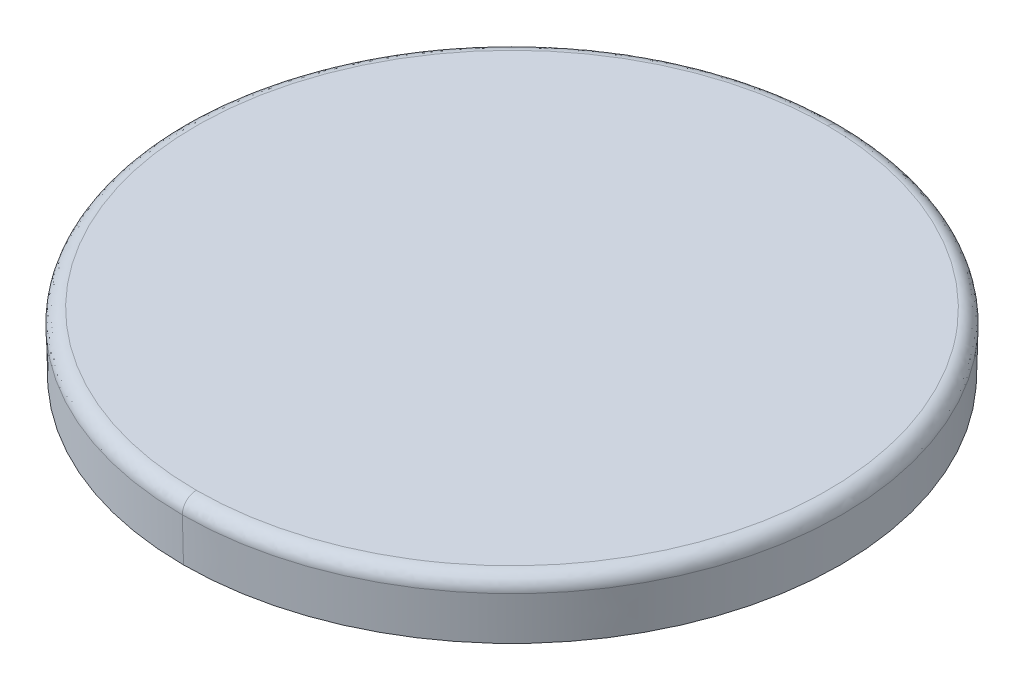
ISO-10303-21;
HEADER;
FILE_DESCRIPTION(('STEP AP214'),'2;1');
FILE_NAME('part.step','',(''),(''),'','','');
FILE_SCHEMA(('AUTOMOTIVE_DESIGN { 1 0 10303 214 1 1 1 1 }'));
ENDSEC;
DATA;
#1=APPLICATION_CONTEXT('core data for automotive mechanical design processes');
#2=APPLICATION_PROTOCOL_DEFINITION('international standard','automotive_design',2000,#1);
#3=PRODUCT_CONTEXT('',#1,'mechanical');
#4=PRODUCT('Part','Part','',(#3));
#5=PRODUCT_RELATED_PRODUCT_CATEGORY('part','',(#4));
#6=PRODUCT_DEFINITION_FORMATION('','',#4);
#7=PRODUCT_DEFINITION_CONTEXT('part definition',#1,'design');
#8=PRODUCT_DEFINITION('design','',#6,#7);
#9=PRODUCT_DEFINITION_SHAPE('','',#8);
#10=(LENGTH_UNIT() NAMED_UNIT(*) SI_UNIT(.MILLI.,.METRE.));
#11=(NAMED_UNIT(*) PLANE_ANGLE_UNIT() SI_UNIT($,.RADIAN.));
#12=(NAMED_UNIT(*) SI_UNIT($,.STERADIAN.) SOLID_ANGLE_UNIT());
#13=UNCERTAINTY_MEASURE_WITH_UNIT(LENGTH_MEASURE(1.E-05),#10,'distance_accuracy_value','');
#14=(GEOMETRIC_REPRESENTATION_CONTEXT(3) GLOBAL_UNCERTAINTY_ASSIGNED_CONTEXT((#13)) GLOBAL_UNIT_ASSIGNED_CONTEXT((#10,
#11,#12)) REPRESENTATION_CONTEXT('',''));
#15=CARTESIAN_POINT('',(0.,0.,0.));
#16=DIRECTION('',(0.,0.,1.));
#17=DIRECTION('',(1.,0.,0.));
#18=AXIS2_PLACEMENT_3D('',#15,#16,#17);
#19=CARTESIAN_POINT('',(14.6,13.2498470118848,7.36542035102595));
#20=CARTESIAN_POINT('',(28.130840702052,13.2498470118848,7.36542035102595));
#21=CARTESIAN_POINT('',(28.130840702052,13.2498470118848,-6.16542035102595));
#22=CARTESIAN_POINT('',(14.6,13.2498470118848,-6.16542035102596));
#23=CARTESIAN_POINT('',(14.6,13.2558690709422,7.55391333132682));
#24=CARTESIAN_POINT('',(28.5078266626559,13.2558690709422,7.5539133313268));
#25=CARTESIAN_POINT('',(28.5078266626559,13.2558690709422,-6.35391333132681));
#26=CARTESIAN_POINT('',(14.6,13.2558690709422,-6.35391333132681));
#27=CARTESIAN_POINT('',(14.6,13.1207662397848,7.68548336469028));
#28=CARTESIAN_POINT('',(28.7709667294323,13.1207662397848,7.68548336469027));
#29=CARTESIAN_POINT('',(28.7709667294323,13.1207662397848,-6.48548336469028));
#30=CARTESIAN_POINT('',(14.6,13.1207662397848,-6.48548336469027));
#31=CARTESIAN_POINT('',(14.6,12.9325106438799,7.67448976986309));
#32=CARTESIAN_POINT('',(28.7489795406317,12.9325106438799,7.6744897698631));
#33=CARTESIAN_POINT('',(28.7489795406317,12.9325106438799,-6.4744897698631));
#34=CARTESIAN_POINT('',(14.6,12.9325106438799,-6.4744897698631));
#35=(BOUNDED_SURFACE() B_SPLINE_SURFACE(3,3,((#19,#20,#21,#22),(#23,#24,#25,#26),(#27,#28,#29,
#30),(#31,#32,#33,#34)),.UNSPECIFIED.,.F.,.F.,.F.) B_SPLINE_SURFACE_WITH_KNOTS((4,4),(4,4),
(0.042813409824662,0.957411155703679),(0.,1.),
.UNSPECIFIED.) GEOMETRIC_REPRESENTATION_ITEM() RATIONAL_B_SPLINE_SURFACE(((0.969088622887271,
0.323029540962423,0.323029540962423,0.969088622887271),(0.758820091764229,0.252940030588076,
0.252940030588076,0.758820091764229),(0.758871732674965,0.252957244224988,0.252957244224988,
0.758871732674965),(0.969243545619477,0.323081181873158,0.323081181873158,0.969243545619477))) REPRESENTATION_ITEM('') SURFACE());
#36=CARTESIAN_POINT('',(14.6,12.942191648,0.6));
#37=DIRECTION('',(0.,1.,0.));
#38=DIRECTION('',(0.,0.,1.));
#39=AXIS2_PLACEMENT_3D('',#36,#37,#38);
#40=CIRCLE('',#39,7.074898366);
#41=CARTESIAN_POINT('',(14.6,12.9421916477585,7.67489836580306));
#42=VERTEX_POINT('',#41);
#43=CARTESIAN_POINT('',(14.5999999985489,12.9421916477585,-6.47489836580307));
#44=VERTEX_POINT('',#43);
#45=EDGE_CURVE('E84',#42,#44,#40,.T.);
#46=CARTESIAN_POINT('',(14.5999999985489,12.9421916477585,-6.47489836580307));
#47=CARTESIAN_POINT('',(14.6,13.1215156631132,-6.47956736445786));
#48=CARTESIAN_POINT('',(14.6,13.2499999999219,-6.35438478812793));
#49=CARTESIAN_POINT('',(14.6,13.2500000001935,-6.17499999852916));
#50=(BOUNDED_CURVE() B_SPLINE_CURVE(3,(#46,#47,#48,#49),.UNSPECIFIED.,.F.,
.F.) B_SPLINE_CURVE_WITH_KNOTS((4,4),(0.0624574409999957,0.937542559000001),
.UNSPECIFIED.) CURVE() GEOMETRIC_REPRESENTATION_ITEM() RATIONAL_B_SPLINE_CURVE((0.955831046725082,
0.76329091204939,0.76329091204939,0.95583104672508)) REPRESENTATION_ITEM(''));
#51=CARTESIAN_POINT('',(14.6,13.2500000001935,-6.17499999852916));
#52=VERTEX_POINT('',#51);
#53=EDGE_CURVE('E92',#44,#52,#50,.T.);
#54=CARTESIAN_POINT('',(14.6,13.2500000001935,7.37499999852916));
#55=CARTESIAN_POINT('',(14.7504701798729,13.25,7.37499999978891));
#56=CARTESIAN_POINT('',(14.9757398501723,13.25,7.3675055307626));
#57=CARTESIAN_POINT('',(15.2377921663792,13.25,7.34564666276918));
#58=CARTESIAN_POINT('',(15.3686277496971,13.25,7.33143839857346));
#59=CARTESIAN_POINT('',(15.4339978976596,13.25,7.32351455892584));
#60=CARTESIAN_POINT('',(15.4620034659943,13.25,7.31994297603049));
#61=CARTESIAN_POINT('',(15.4806715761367,13.25,7.31752288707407));
#62=CARTESIAN_POINT('',(15.4887884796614,13.25,7.31645609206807));
#63=CARTESIAN_POINT('',(15.6681011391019,13.25,7.2924547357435));
#64=CARTESIAN_POINT('',(15.9193827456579,13.25,7.2491320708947));
#65=CARTESIAN_POINT('',(16.2092796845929,13.25,7.18207176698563));
#66=CARTESIAN_POINT('',(16.3534119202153,13.25,7.14441231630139));
#67=CARTESIAN_POINT('',(16.4252739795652,13.25,7.12455026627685));
#68=CARTESIAN_POINT('',(16.4560282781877,13.25,7.11581674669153));
#69=CARTESIAN_POINT('',(16.4765214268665,13.25,7.1099452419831));
#70=CARTESIAN_POINT('',(16.4854779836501,13.25,7.10735964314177));
#71=CARTESIAN_POINT('',(16.6813522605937,13.25,7.0502457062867));
#72=CARTESIAN_POINT('',(16.953593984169,13.25,6.9581659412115));
#73=CARTESIAN_POINT('',(17.2637076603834,13.25,6.83070498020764));
#74=CARTESIAN_POINT('',(17.4168890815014,13.25,6.76196585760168));
#75=CARTESIAN_POINT('',(17.4930109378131,13.25,6.72634413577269));
#76=CARTESIAN_POINT('',(17.5255341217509,13.25,6.71080936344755));
#77=CARTESIAN_POINT('',(17.5471939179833,13.25,6.70039322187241));
#78=CARTESIAN_POINT('',(17.5567462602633,13.25,6.69577258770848));
#79=CARTESIAN_POINT('',(17.7620036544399,13.25,6.59572848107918));
#80=CARTESIAN_POINT('',(18.0439136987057,13.25,6.4413731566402));
#81=CARTESIAN_POINT('',(18.3590448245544,13.25,6.23833791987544));
#82=CARTESIAN_POINT('',(18.5131694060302,13.25,6.13108179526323));
#83=CARTESIAN_POINT('',(18.5893714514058,13.25,6.07601910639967));
#84=CARTESIAN_POINT('',(18.6218451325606,13.25,6.05211339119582));
#85=CARTESIAN_POINT('',(18.6434532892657,13.25,6.03610793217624));
#86=CARTESIAN_POINT('',(18.6531220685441,13.25,6.02890702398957));
#87=CARTESIAN_POINT('',(18.8550469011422,13.25,5.87748761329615));
#88=CARTESIAN_POINT('',(19.1275135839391,13.25,5.64995263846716));
#89=CARTESIAN_POINT('',(19.4233349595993,13.25,5.36040397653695));
#90=CARTESIAN_POINT('',(19.5657315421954,13.25,5.20960684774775));
#91=CARTESIAN_POINT('',(19.635551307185,13.25,5.13270258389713));
#92=CARTESIAN_POINT('',(19.6651786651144,13.25,5.09942096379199));
#93=CARTESIAN_POINT('',(19.6848645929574,13.25,5.07716151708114));
#94=CARTESIAN_POINT('',(19.6938516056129,13.25,5.06693896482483));
#95=CARTESIAN_POINT('',(19.8740592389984,13.25,4.86048340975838));
#96=CARTESIAN_POINT('',(20.1104507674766,13.25,4.55643017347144));
#97=CARTESIAN_POINT('',(20.354707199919,13.25,4.1796748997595));
#98=CARTESIAN_POINT('',(20.4689519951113,13.25,3.98579063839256));
#99=CARTESIAN_POINT('',(20.5162247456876,13.25,3.90151739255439));
#100=CARTESIAN_POINT('',(20.5473645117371,13.25,3.84507300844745));
#101=CARTESIAN_POINT('',(20.5618470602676,13.25,3.81840620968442));
#102=CARTESIAN_POINT('',(20.706694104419,13.25,3.54686796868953));
#103=CARTESIAN_POINT('',(20.8768334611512,13.25,3.1757746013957));
#104=CARTESIAN_POINT('',(21.0350968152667,13.25,2.72700817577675));
#105=CARTESIAN_POINT('',(21.0943027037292,13.25,2.53128881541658));
#106=CARTESIAN_POINT('',(21.1318574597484,13.25,2.40005571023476));
#107=CARTESIAN_POINT('',(21.1493182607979,13.25,2.33547413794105));
#108=CARTESIAN_POINT('',(21.2354192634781,13.25,1.99656498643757));
#109=CARTESIAN_POINT('',(21.2871500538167,13.25,1.72330866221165));
#110=CARTESIAN_POINT('',(21.3574024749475,13.25,1.16385087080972));
#111=CARTESIAN_POINT('',(21.3749771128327,13.25,0.88192571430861));
#112=CARTESIAN_POINT('',(21.3750114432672,13.25,0.459037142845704));
#113=CARTESIAN_POINT('',(21.370623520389,13.25,0.31825740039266));
#114=CARTESIAN_POINT('',(21.3530489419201,13.25,0.0370641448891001));
#115=CARTESIAN_POINT('',(21.3396807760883,13.25,-0.104796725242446));
#116=CARTESIAN_POINT('',(21.304871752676,13.25,-0.382362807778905));
#117=CARTESIAN_POINT('',(21.2723511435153,13.25,-0.589464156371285));
#118=CARTESIAN_POINT('',(21.2302097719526,13.25,-0.794955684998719));
#119=CARTESIAN_POINT('',(21.1999775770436,13.25,-0.93159229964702));
#120=CARTESIAN_POINT('',(21.1833676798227,13.25,-1.0014050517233));
#121=CARTESIAN_POINT('',(21.099221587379,13.25,-1.33284133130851));
#122=CARTESIAN_POINT('',(20.9751592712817,13.25,-1.72177097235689));
#123=CARTESIAN_POINT('',(20.7900176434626,13.25,-2.16013290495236));
#124=CARTESIAN_POINT('',(20.6873462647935,13.25,-2.37546654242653));
#125=CARTESIAN_POINT('',(20.6411798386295,13.25,-2.46692795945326));
#126=CARTESIAN_POINT('',(20.6099212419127,13.25,-2.52771903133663));
#127=CARTESIAN_POINT('',(20.5931108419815,13.25,-2.55978693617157));
#128=CARTESIAN_POINT('',(20.4565838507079,13.25,-2.8158221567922));
#129=CARTESIAN_POINT('',(20.2563797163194,13.25,-3.14483220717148));
#130=CARTESIAN_POINT('',(19.991013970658,13.25,-3.50702933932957));
#131=CARTESIAN_POINT('',(19.8503825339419,13.25,-3.68271592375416));
#132=CARTESIAN_POINT('',(19.7780796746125,13.25,-3.76920622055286));
#133=CARTESIAN_POINT('',(19.7466669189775,13.25,-3.80598356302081));
#134=CARTESIAN_POINT('',(19.725630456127,13.25,-3.83043736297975));
#135=CARTESIAN_POINT('',(19.7142133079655,13.25,-3.84360799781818));
#136=CARTESIAN_POINT('',(19.5482720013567,13.25,-4.03377888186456));
#137=CARTESIAN_POINT('',(19.3012054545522,13.25,-4.28866783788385));
#138=CARTESIAN_POINT('',(18.9905673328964,13.25,-4.56226001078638));
#139=CARTESIAN_POINT('',(18.8296498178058,13.25,-4.69311152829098));
#140=CARTESIAN_POINT('',(18.7477914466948,13.25,-4.7570511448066));
#141=CARTESIAN_POINT('',(18.7124093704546,13.25,-4.78413537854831));
#142=CARTESIAN_POINT('',(18.6887546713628,13.25,-4.80212076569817));
#143=CARTESIAN_POINT('',(18.6757448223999,13.25,-4.81194009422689));
#144=CARTESIAN_POINT('',(18.493082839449,13.25,-4.94895848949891));
#145=CARTESIAN_POINT('',(18.2271224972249,13.25,-5.1294133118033));
#146=CARTESIAN_POINT('',(17.9026873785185,13.25,-5.31722384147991));
#147=CARTESIAN_POINT('',(17.7369328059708,13.25,-5.4054490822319));
#148=CARTESIAN_POINT('',(17.6531712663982,13.25,-5.44814169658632));
#149=CARTESIAN_POINT('',(17.6170839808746,13.25,-5.46613424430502));
#150=CARTESIAN_POINT('',(17.5929836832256,13.25,-5.47806165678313));
#151=CARTESIAN_POINT('',(17.5796079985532,13.25,-5.48462760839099));
#152=CARTESIAN_POINT('',(17.3962158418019,13.25,-5.57404815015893));
#153=CARTESIAN_POINT('',(17.1327850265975,13.25,-5.68893257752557));
#154=CARTESIAN_POINT('',(16.8175316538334,13.25,-5.80309081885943));
#155=CARTESIAN_POINT('',(16.6579256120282,13.25,-5.85520154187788));
#156=CARTESIAN_POINT('',(16.5776277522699,13.25,-5.88001480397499));
#157=CARTESIAN_POINT('',(16.5431083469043,13.25,-5.89038289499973));
#158=CARTESIAN_POINT('',(16.5200718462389,13.25,-5.89723580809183));
#159=CARTESIAN_POINT('',(16.5072159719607,13.25,-5.90101950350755));
#160=CARTESIAN_POINT('',(16.3335444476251,13.25,-5.95168794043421));
#161=CARTESIAN_POINT('',(16.0862448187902,13.25,-6.01383442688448));
#162=CARTESIAN_POINT('',(15.7940250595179,13.25,-6.06991416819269));
#163=CARTESIAN_POINT('',(15.6469892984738,13.25,-6.09384791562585));
#164=CARTESIAN_POINT('',(15.5732399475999,13.25,-6.1047882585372));
#165=CARTESIAN_POINT('',(15.5415834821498,13.25,-6.10925700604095));
#166=CARTESIAN_POINT('',(15.5204681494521,13.25,-6.11218728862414));
#167=CARTESIAN_POINT('',(15.508657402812,13.25,-6.11379516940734));
#168=CARTESIAN_POINT('',(15.2010604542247,13.25,-6.15501474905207));
#169=CARTESIAN_POINT('',(14.9012816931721,13.25,-6.17499999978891));
#170=CARTESIAN_POINT('',(14.6,13.2500000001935,-6.17499999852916));
#171=(BOUNDED_CURVE() B_SPLINE_CURVE(3,(#54,#55,#56,#57,#58,#59,#60,#61,#62,#63,#64,#65,#66,#67,
#68,#69,#70,#71,#72,#73,#74,#75,#76,#77,#78,#79,#80,#81,#82,#83,#84,#85,#86,#87,#88,#89,#90,#91,
#92,#93,#94,#95,#96,#97,#98,#99,#100,#101,#102,#103,#104,#105,#106,#107,#108,#109,#110,#111,
#112,#113,#114,#115,#116,#117,#118,#119,#120,#121,#122,#123,#124,#125,#126,#127,#128,#129,#130,
#131,#132,#133,#134,#135,#136,#137,#138,#139,#140,#141,#142,#143,#144,#145,#146,#147,#148,#149,
#150,#151,#152,#153,#154,#155,#156,#157,#158,#159,#160,#161,#162,#163,#164,#165,#166,#167,#168,
#169,#170),.UNSPECIFIED.,.F.,.F.) B_SPLINE_CURVE_WITH_KNOTS((4,1,1,1,1,2,2,1,1,1,1,2,2,1,1,1,1,
2,2,1,1,1,1,2,2,1,1,1,1,2,2,1,1,1,2,2,1,1,2,2,2,2,2,2,1,2,2,1,1,1,2,2,1,1,1,1,2,2,1,1,1,1,2,2,1,
1,1,1,2,2,1,1,1,1,2,2,1,1,1,1,2,2,4),(0.,0.0312500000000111,0.0468750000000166,
0.0546875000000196,0.0585937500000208,0.0605468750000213,0.0625000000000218,0.0937500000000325,
0.109375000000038,0.117187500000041,0.121093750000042,0.123046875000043,0.125000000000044,
0.156250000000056,0.171875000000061,0.179687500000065,0.183593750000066,0.185546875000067,
0.187500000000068,0.218750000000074,0.234375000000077,0.242187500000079,0.24609375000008,
0.24804687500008,0.250000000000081,0.281250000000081,0.296875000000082,0.304687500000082,
0.308593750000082,0.310546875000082,0.312500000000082,0.343750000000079,0.359375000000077,
0.367187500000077,0.371093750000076,0.375000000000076,0.406250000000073,0.421875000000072,
0.429687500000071,0.43750000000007,0.468750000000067,0.5,0.515625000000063,0.531250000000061,
0.54687500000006,0.554687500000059,0.562500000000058,0.593750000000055,0.609375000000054,
0.617187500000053,0.621093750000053,0.625000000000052,0.656250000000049,0.671875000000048,
0.679687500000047,0.683593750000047,0.685546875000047,0.687500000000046,0.718750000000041,
0.734375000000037,0.742187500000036,0.746093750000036,0.748046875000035,0.750000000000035,
0.781250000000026,0.796875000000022,0.80468750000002,0.808593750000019,0.810546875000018,
0.812500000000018,0.84375,0.859375,0.8671875,0.871093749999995,0.873046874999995,0.875,0.90625,
0.921875,0.9296875,0.933593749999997,0.935546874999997,0.9375,1.),
.UNSPECIFIED.) CURVE() GEOMETRIC_REPRESENTATION_ITEM() RATIONAL_B_SPLINE_CURVE((1.,1.,1.,1.,1.,
1.,1.,1.,1.,1.,1.,1.,1.,1.,1.,1.,1.,1.,1.,1.,1.,1.,1.,1.,1.,1.,1.,1.,1.,1.,1.,1.,1.,1.,1.,1.,1.,
1.,1.,1.,1.,1.,1.,1.,1.,1.,1.,1.,1.,1.,1.,1.,1.,1.,1.,1.,1.,1.,1.,1.,1.,1.,1.,1.,1.,1.,1.,1.,1.,
1.,1.,1.,1.,1.,1.,1.,1.,1.,1.,1.,1.,1.,1.,1.,1.,1.,1.,1.,1.,1.,1.,1.,1.,1.,1.,1.,1.,1.,1.,1.,1.,
1.,1.,1.,1.,1.,1.,1.,1.,1.,1.,1.,1.,1.,1.,1.,1.)) REPRESENTATION_ITEM(''));
#172=CARTESIAN_POINT('',(14.6,13.2500000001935,7.37499999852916));
#173=VERTEX_POINT('',#172);
#174=EDGE_CURVE('E11',#173,#52,#171,.T.);
#175=CARTESIAN_POINT('',(14.6,13.2500000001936,7.37499999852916));
#176=CARTESIAN_POINT('',(14.6,13.2499999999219,7.55438478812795));
#177=CARTESIAN_POINT('',(14.6,13.1215156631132,7.67956736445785));
#178=CARTESIAN_POINT('',(14.6,12.9421916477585,7.67489836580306));
#179=(BOUNDED_CURVE() B_SPLINE_CURVE(3,(#175,#176,#177,#178),.UNSPECIFIED.,.F.,
.F.) B_SPLINE_CURVE_WITH_KNOTS((4,4),(0.0624574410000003,0.937542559),
.UNSPECIFIED.) CURVE() GEOMETRIC_REPRESENTATION_ITEM() RATIONAL_B_SPLINE_CURVE((0.955831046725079,
0.76329091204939,0.763290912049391,0.955831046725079)) REPRESENTATION_ITEM(''));
#180=EDGE_CURVE('E21',#173,#42,#179,.T.);
#181=ORIENTED_EDGE('',*,*,#45,.T.);
#182=ORIENTED_EDGE('',*,*,#53,.T.);
#183=ORIENTED_EDGE('',*,*,#174,.F.);
#184=ORIENTED_EDGE('',*,*,#180,.T.);
#185=EDGE_LOOP('',(#181,#182,#183,#184));
#186=FACE_BOUND('',#185,.T.);
#187=ADVANCED_FACE('F16',(#186),#35,.T.);
#188=CARTESIAN_POINT('',(7.7437,13.25,-6.2563));
#189=DIRECTION('',(0.,1.,0.));
#190=DIRECTION('',(1.,0.,0.));
#191=AXIS2_PLACEMENT_3D('',#188,#189,#190);
#192=PLANE('',#191);
#193=ORIENTED_EDGE('',*,*,#174,.T.);
#194=CARTESIAN_POINT('',(14.6,13.2500000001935,7.37499999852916));
#195=CARTESIAN_POINT('',(1.05000000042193,13.2500000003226,7.37499999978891));
#196=CARTESIAN_POINT('',(1.05000000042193,13.2500000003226,-6.17499999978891));
#197=CARTESIAN_POINT('',(14.6,13.2500000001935,-6.17499999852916));
#198=(BOUNDED_CURVE() B_SPLINE_CURVE(3,(#194,#195,#196,#197),.UNSPECIFIED.,.F.,
.F.) B_SPLINE_CURVE_WITH_KNOTS((4,4),(0.,1.),
.UNSPECIFIED.) CURVE() GEOMETRIC_REPRESENTATION_ITEM() RATIONAL_B_SPLINE_CURVE((0.955831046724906,
0.318610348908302,0.318610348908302,0.955831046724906)) REPRESENTATION_ITEM(''));
#199=EDGE_CURVE('E29',#173,#52,#198,.T.);
#200=ORIENTED_EDGE('',*,*,#199,.F.);
#201=EDGE_LOOP('',(#193,#200));
#202=FACE_BOUND('',#201,.T.);
#203=ADVANCED_FACE('F122',(#202),#192,.T.);
#204=CARTESIAN_POINT('',(7.465028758,12.,7.734971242));
#205=DIRECTION('',(0.,-1.,0.));
#206=DIRECTION('',(0.,0.,-1.));
#207=AXIS2_PLACEMENT_3D('',#204,#205,#206);
#208=PLANE('',#207);
#209=CARTESIAN_POINT('',(14.6,12.,0.6));
#210=DIRECTION('',(0.,-1.,0.));
#211=DIRECTION('',(0.,0.,1.));
#212=AXIS2_PLACEMENT_3D('',#209,#210,#211);
#213=CIRCLE('',#212,7.05036684);
#214=CARTESIAN_POINT('',(14.6,12.,7.65036684));
#215=VERTEX_POINT('',#214);
#216=CARTESIAN_POINT('',(14.6,12.,-6.45036684));
#217=VERTEX_POINT('',#216);
#218=EDGE_CURVE('E63',#215,#217,#213,.T.);
#219=ORIENTED_EDGE('',*,*,#218,.T.);
#220=CARTESIAN_POINT('',(14.6,12.,0.6));
#221=DIRECTION('',(0.,-1.,0.));
#222=DIRECTION('',(0.,0.,1.));
#223=AXIS2_PLACEMENT_3D('',#220,#221,#222);
#224=CIRCLE('',#223,7.05036684);
#225=EDGE_CURVE('E67',#217,#215,#224,.T.);
#226=ORIENTED_EDGE('',*,*,#225,.T.);
#227=EDGE_LOOP('',(#219,#226));
#228=FACE_BOUND('',#227,.T.);
#229=ADVANCED_FACE('F65',(#228),#208,.T.);
#230=CARTESIAN_POINT('',(14.6,13.2499988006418,-6.17415158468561));
#231=CARTESIAN_POINT('',(1.05169683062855,13.2499988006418,-6.17415158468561));
#232=CARTESIAN_POINT('',(1.05169683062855,13.2499988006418,7.37415158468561));
#233=CARTESIAN_POINT('',(14.6,13.2499988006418,7.37415158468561));
#234=CARTESIAN_POINT('',(14.6,13.2505216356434,-6.3590257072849));
#235=CARTESIAN_POINT('',(0.681948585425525,13.2505216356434,-6.35902570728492));
#236=CARTESIAN_POINT('',(0.681948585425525,13.2505216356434,7.5590257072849));
#237=CARTESIAN_POINT('',(14.6,13.2505216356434,7.5590257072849));
#238=CARTESIAN_POINT('',(14.6,13.1160818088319,-6.48520980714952));
#239=CARTESIAN_POINT('',(0.429580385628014,13.1160818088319,-6.48520980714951));
#240=CARTESIAN_POINT('',(0.429580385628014,13.1160818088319,7.6852098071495));
#241=CARTESIAN_POINT('',(14.6,13.1160818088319,7.68520980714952));
#242=CARTESIAN_POINT('',(14.6,12.9325106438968,-6.47448976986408));
#243=CARTESIAN_POINT('',(0.451020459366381,12.9325106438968,-6.47448976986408));
#244=CARTESIAN_POINT('',(0.451020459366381,12.9325106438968,7.67448976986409));
#245=CARTESIAN_POINT('',(14.6,12.9325106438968,7.67448976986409));
#246=(BOUNDED_SURFACE() B_SPLINE_SURFACE(3,3,((#230,#231,#232,#233),(#234,#235,#236,#237),(#238,
#239,#240,#241),(#242,#243,#244,#245)),.UNSPECIFIED.,.F.,.F.,
.F.) B_SPLINE_SURFACE_WITH_KNOTS((4,4),(4,4),(0.0607288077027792,0.95741115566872),(0.,1.),
.UNSPECIFIED.) GEOMETRIC_REPRESENTATION_ITEM() RATIONAL_B_SPLINE_SURFACE(((0.956974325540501,
0.318991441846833,0.318991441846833,0.956974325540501),(0.758902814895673,0.252967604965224,
0.252967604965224,0.758902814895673),(0.762992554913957,0.254330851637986,0.254330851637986,
0.762992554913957),(0.969243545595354,0.323081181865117,0.323081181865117,0.969243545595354))) REPRESENTATION_ITEM('') SURFACE());
#247=CARTESIAN_POINT('',(14.6,12.942191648,0.6));
#248=DIRECTION('',(0.,1.,0.));
#249=DIRECTION('',(0.,0.,1.));
#250=AXIS2_PLACEMENT_3D('',#247,#248,#249);
#251=CIRCLE('',#250,7.074898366);
#252=EDGE_CURVE('E72',#44,#42,#251,.T.);
#253=ORIENTED_EDGE('',*,*,#53,.F.);
#254=ORIENTED_EDGE('',*,*,#252,.T.);
#255=ORIENTED_EDGE('',*,*,#180,.F.);
#256=ORIENTED_EDGE('',*,*,#199,.T.);
#257=EDGE_LOOP('',(#253,#254,#255,#256));
#258=FACE_BOUND('',#257,.T.);
#259=ADVANCED_FACE('F121',(#258),#246,.T.);
#260=CARTESIAN_POINT('',(14.6,12.,0.6));
#261=DIRECTION('',(0.,1.,0.));
#262=DIRECTION('',(0.,0.,1.));
#263=AXIS2_PLACEMENT_3D('',#260,#261,#262);
#264=CONICAL_SURFACE('',#263,7.05036684,0.0260307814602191);
#265=DIRECTION('',(0.,0.999661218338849,-0.0260278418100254));
#266=VECTOR('',#265,1.);
#267=CARTESIAN_POINT('',(14.6,12.,-6.45036684));
#268=LINE('',#267,#266);
#269=EDGE_CURVE('E77',#217,#44,#268,.T.);
#270=ORIENTED_EDGE('',*,*,#269,.F.);
#271=ORIENTED_EDGE('',*,*,#218,.F.);
#272=DIRECTION('',(0.,0.999661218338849,0.0260278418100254));
#273=VECTOR('',#272,1.);
#274=CARTESIAN_POINT('',(14.6,12.,7.65036684));
#275=LINE('',#274,#273);
#276=EDGE_CURVE('E73',#215,#42,#275,.T.);
#277=ORIENTED_EDGE('',*,*,#276,.T.);
#278=ORIENTED_EDGE('',*,*,#252,.F.);
#279=EDGE_LOOP('',(#270,#271,#277,#278));
#280=FACE_BOUND('',#279,.T.);
#281=ADVANCED_FACE('F78',(#280),#264,.T.);
#282=CARTESIAN_POINT('',(14.6,12.,0.6));
#283=DIRECTION('',(0.,1.,0.));
#284=DIRECTION('',(0.,0.,1.));
#285=AXIS2_PLACEMENT_3D('',#282,#283,#284);
#286=CONICAL_SURFACE('',#285,7.05036684,0.0260307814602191);
#287=ORIENTED_EDGE('',*,*,#225,.F.);
#288=ORIENTED_EDGE('',*,*,#269,.T.);
#289=ORIENTED_EDGE('',*,*,#45,.F.);
#290=ORIENTED_EDGE('',*,*,#276,.F.);
#291=EDGE_LOOP('',(#287,#288,#289,#290));
#292=FACE_BOUND('',#291,.T.);
#293=ADVANCED_FACE('F86',(#292),#286,.T.);
#294=CLOSED_SHELL('',(#187,#203,#229,#259,#281,#293));
#295=MANIFOLD_SOLID_BREP('B1',#294);
#296=ADVANCED_BREP_SHAPE_REPRESENTATION('',(#18,#295),#14);
#297=SHAPE_DEFINITION_REPRESENTATION(#9,#296);
ENDSEC;
END-ISO-10303-21;
